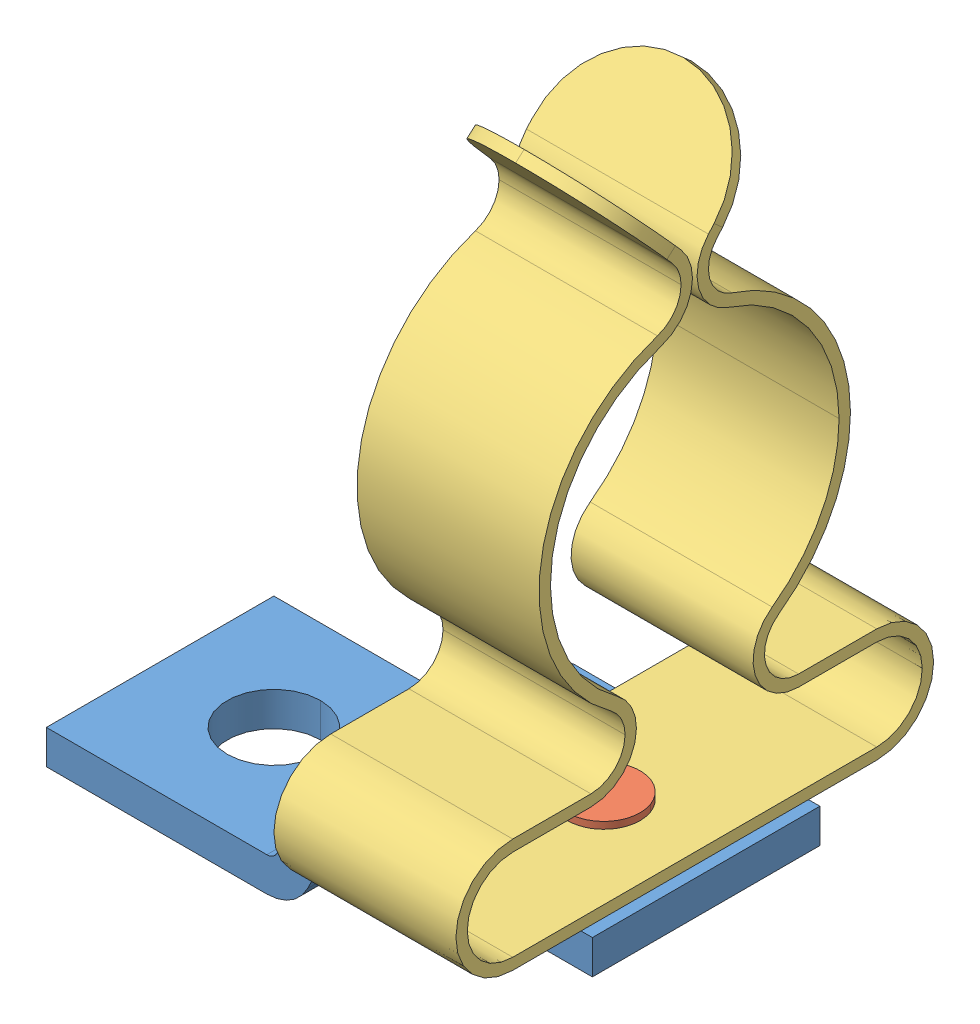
SolidWorks assembly 36257.SLDASM, configuration Default (file format 8000). Lengths in mm.
Overall size (24 32.5 21).
3 component instances, 3 part files, 0 mates.
Components (placement in the parent):
- 36257_01-1: 36257_01.SLDPRT [Default] at origin size (24 5.5 10)
- 36257_02-1: 36257_02.SLDPRT [Default] at origin size (6 3.3 6)
- 36257_03-1: 36257_03.SLDPRT [Default] at origin size (8 27 21)
